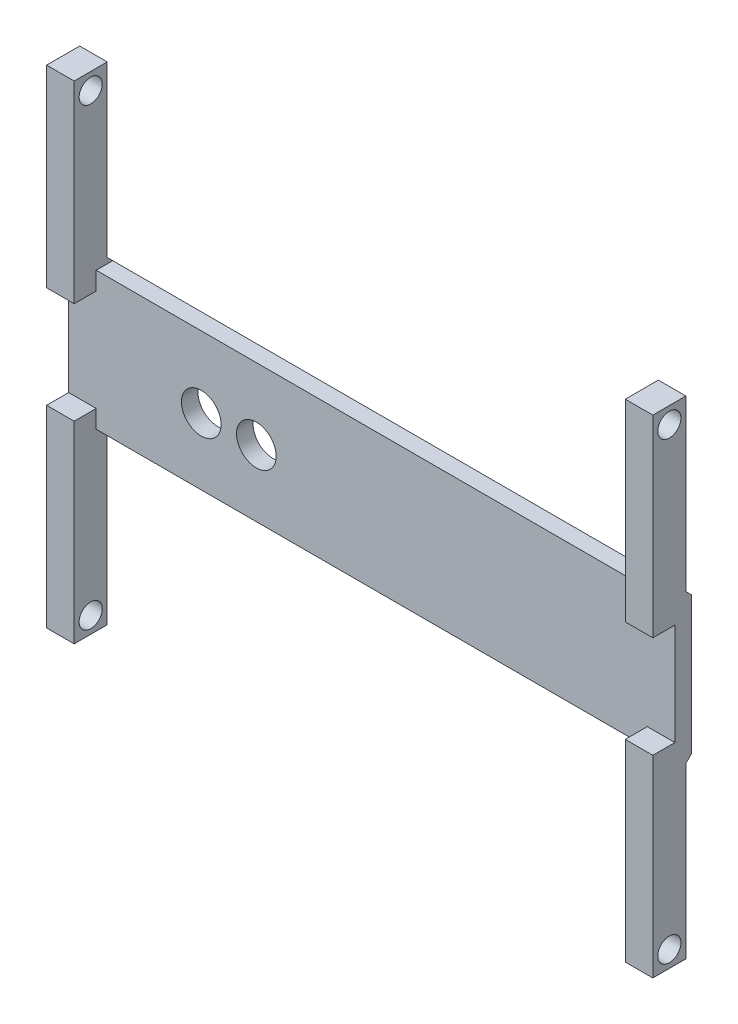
ISO-10303-21;
HEADER;
FILE_DESCRIPTION(('STEP AP214'),'2;1');
FILE_NAME('part.step','',(''),(''),'','','');
FILE_SCHEMA(('AUTOMOTIVE_DESIGN { 1 0 10303 214 1 1 1 1 }'));
ENDSEC;
DATA;
#1=APPLICATION_CONTEXT('core data for automotive mechanical design processes');
#2=APPLICATION_PROTOCOL_DEFINITION('international standard','automotive_design',2000,#1);
#3=PRODUCT_CONTEXT('',#1,'mechanical');
#4=PRODUCT('Part','Part','',(#3));
#5=PRODUCT_RELATED_PRODUCT_CATEGORY('part','',(#4));
#6=PRODUCT_DEFINITION_FORMATION('','',#4);
#7=PRODUCT_DEFINITION_CONTEXT('part definition',#1,'design');
#8=PRODUCT_DEFINITION('design','',#6,#7);
#9=PRODUCT_DEFINITION_SHAPE('','',#8);
#10=(LENGTH_UNIT() NAMED_UNIT(*) SI_UNIT(.MILLI.,.METRE.));
#11=(NAMED_UNIT(*) PLANE_ANGLE_UNIT() SI_UNIT($,.RADIAN.));
#12=(NAMED_UNIT(*) SI_UNIT($,.STERADIAN.) SOLID_ANGLE_UNIT());
#13=UNCERTAINTY_MEASURE_WITH_UNIT(LENGTH_MEASURE(1.E-05),#10,'distance_accuracy_value','');
#14=(GEOMETRIC_REPRESENTATION_CONTEXT(3) GLOBAL_UNCERTAINTY_ASSIGNED_CONTEXT((#13)) GLOBAL_UNIT_ASSIGNED_CONTEXT((#10,
#11,#12)) REPRESENTATION_CONTEXT('',''));
#15=CARTESIAN_POINT('',(0.,0.,0.));
#16=DIRECTION('',(0.,0.,1.));
#17=DIRECTION('',(1.,0.,0.));
#18=AXIS2_PLACEMENT_3D('',#15,#16,#17);
#19=CARTESIAN_POINT('',(50.,-9.22974479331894,0.));
#20=DIRECTION('',(0.,-1.,0.));
#21=DIRECTION('',(1.,0.,0.));
#22=AXIS2_PLACEMENT_3D('',#19,#20,#21);
#23=PLANE('',#22);
#24=DIRECTION('',(0.,0.,1.));
#25=VECTOR('',#24,1.);
#26=CARTESIAN_POINT('',(55.,-9.22974479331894,3.));
#27=LINE('',#26,#25);
#28=CARTESIAN_POINT('',(55.,-9.22974479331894,3.));
#29=VERTEX_POINT('',#28);
#30=CARTESIAN_POINT('',(55.,-9.22974479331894,7.00000000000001));
#31=VERTEX_POINT('',#30);
#32=EDGE_CURVE('E488',#29,#31,#27,.T.);
#33=ORIENTED_EDGE('',*,*,#32,.F.);
#34=DIRECTION('',(-1.,0.,0.));
#35=VECTOR('',#34,1.);
#36=CARTESIAN_POINT('',(0.,-9.22974479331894,3.));
#37=LINE('',#36,#35);
#38=CARTESIAN_POINT('',(50.,-9.22974479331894,3.));
#39=VERTEX_POINT('',#38);
#40=EDGE_CURVE('E220',#29,#39,#37,.T.);
#41=ORIENTED_EDGE('',*,*,#40,.T.);
#42=DIRECTION('',(0.,0.,-1.));
#43=VECTOR('',#42,1.);
#44=CARTESIAN_POINT('',(50.,-9.22974479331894,7.00000000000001));
#45=LINE('',#44,#43);
#46=CARTESIAN_POINT('',(50.,-9.22974479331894,7.00000000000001));
#47=VERTEX_POINT('',#46);
#48=EDGE_CURVE('E250',#47,#39,#45,.T.);
#49=ORIENTED_EDGE('',*,*,#48,.F.);
#50=DIRECTION('',(1.,0.,0.));
#51=VECTOR('',#50,1.);
#52=CARTESIAN_POINT('',(50.,-9.22974479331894,7.00000000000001));
#53=LINE('',#52,#51);
#54=EDGE_CURVE('E261',#47,#31,#53,.T.);
#55=ORIENTED_EDGE('',*,*,#54,.T.);
#56=EDGE_LOOP('',(#33,#41,#49,#55));
#57=FACE_BOUND('',#56,.T.);
#58=ADVANCED_FACE('F39',(#57),#23,.F.);
#59=CARTESIAN_POINT('',(50.,-44.2297447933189,1.00000000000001));
#60=DIRECTION('',(0.,0.,1.));
#61=DIRECTION('',(1.,0.,0.));
#62=AXIS2_PLACEMENT_3D('',#59,#60,#61);
#63=PLANE('',#62);
#64=DIRECTION('',(0.,1.,0.));
#65=VECTOR('',#64,1.);
#66=CARTESIAN_POINT('',(55.,-44.2297447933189,1.00000000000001));
#67=LINE('',#66,#65);
#68=CARTESIAN_POINT('',(55.,-44.2297447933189,1.00000000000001));
#69=VERTEX_POINT('',#68);
#70=CARTESIAN_POINT('',(55.,-13.5,1.00000000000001));
#71=VERTEX_POINT('',#70);
#72=EDGE_CURVE('E56',#69,#71,#67,.T.);
#73=ORIENTED_EDGE('',*,*,#72,.F.);
#74=DIRECTION('',(1.,0.,0.));
#75=VECTOR('',#74,1.);
#76=CARTESIAN_POINT('',(50.,-44.2297447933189,1.00000000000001));
#77=LINE('',#76,#75);
#78=CARTESIAN_POINT('',(50.,-44.2297447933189,1.00000000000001));
#79=VERTEX_POINT('',#78);
#80=EDGE_CURVE('E267',#79,#69,#77,.T.);
#81=ORIENTED_EDGE('',*,*,#80,.F.);
#82=DIRECTION('',(0.,-1.,0.));
#83=VECTOR('',#82,1.);
#84=CARTESIAN_POINT('',(50.,-44.2297447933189,1.00000000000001));
#85=LINE('',#84,#83);
#86=CARTESIAN_POINT('',(50.,-13.5,1.00000000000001));
#87=VERTEX_POINT('',#86);
#88=EDGE_CURVE('E237',#87,#79,#85,.T.);
#89=ORIENTED_EDGE('',*,*,#88,.F.);
#90=DIRECTION('',(1.,0.,0.));
#91=VECTOR('',#90,1.);
#92=CARTESIAN_POINT('',(50.,-13.5,1.00000000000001));
#93=LINE('',#92,#91);
#94=EDGE_CURVE('E255',#87,#71,#93,.T.);
#95=ORIENTED_EDGE('',*,*,#94,.T.);
#96=EDGE_LOOP('',(#73,#81,#89,#95));
#97=FACE_BOUND('',#96,.T.);
#98=ADVANCED_FACE('F523',(#97),#63,.F.);
#99=CARTESIAN_POINT('',(50.,-44.2297447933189,1.00000000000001));
#100=DIRECTION('',(0.,1.,0.));
#101=DIRECTION('',(-1.,0.,0.));
#102=AXIS2_PLACEMENT_3D('',#99,#100,#101);
#103=PLANE('',#102);
#104=DIRECTION('',(0.,0.,-1.));
#105=VECTOR('',#104,1.);
#106=CARTESIAN_POINT('',(55.,-44.2297447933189,7.00000000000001));
#107=LINE('',#106,#105);
#108=CARTESIAN_POINT('',(55.,-44.2297447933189,7.00000000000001));
#109=VERTEX_POINT('',#108);
#110=EDGE_CURVE('E493',#109,#69,#107,.T.);
#111=ORIENTED_EDGE('',*,*,#110,.F.);
#112=DIRECTION('',(1.,0.,0.));
#113=VECTOR('',#112,1.);
#114=CARTESIAN_POINT('',(50.,-44.2297447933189,7.00000000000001));
#115=LINE('',#114,#113);
#116=CARTESIAN_POINT('',(50.,-44.2297447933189,7.00000000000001));
#117=VERTEX_POINT('',#116);
#118=EDGE_CURVE('E264',#117,#109,#115,.T.);
#119=ORIENTED_EDGE('',*,*,#118,.F.);
#120=DIRECTION('',(0.,0.,1.));
#121=VECTOR('',#120,1.);
#122=CARTESIAN_POINT('',(50.,-44.2297447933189,1.00000000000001));
#123=LINE('',#122,#121);
#124=EDGE_CURVE('E241',#79,#117,#123,.T.);
#125=ORIENTED_EDGE('',*,*,#124,.F.);
#126=ORIENTED_EDGE('',*,*,#80,.T.);
#127=EDGE_LOOP('',(#111,#119,#125,#126));
#128=FACE_BOUND('',#127,.T.);
#129=ADVANCED_FACE('F529',(#128),#103,.F.);
#130=CARTESIAN_POINT('',(50.,-44.2297447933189,7.00000000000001));
#131=DIRECTION('',(0.,0.,-1.));
#132=DIRECTION('',(0.,1.,0.));
#133=AXIS2_PLACEMENT_3D('',#130,#131,#132);
#134=PLANE('',#133);
#135=DIRECTION('',(0.,-1.,0.));
#136=VECTOR('',#135,1.);
#137=CARTESIAN_POINT('',(55.,-9.22974479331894,7.00000000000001));
#138=LINE('',#137,#136);
#139=EDGE_CURVE('E490',#31,#109,#138,.T.);
#140=ORIENTED_EDGE('',*,*,#139,.F.);
#141=ORIENTED_EDGE('',*,*,#54,.F.);
#142=DIRECTION('',(0.,1.,0.));
#143=VECTOR('',#142,1.);
#144=CARTESIAN_POINT('',(50.,-44.2297447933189,7.00000000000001));
#145=LINE('',#144,#143);
#146=EDGE_CURVE('E248',#117,#47,#145,.T.);
#147=ORIENTED_EDGE('',*,*,#146,.F.);
#148=ORIENTED_EDGE('',*,*,#118,.T.);
#149=EDGE_LOOP('',(#140,#141,#147,#148));
#150=FACE_BOUND('',#149,.T.);
#151=ADVANCED_FACE('F535',(#150),#134,.F.);
#152=CARTESIAN_POINT('',(50.,-12.5,0.));
#153=DIRECTION('',(0.,0.707106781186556,0.707106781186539));
#154=DIRECTION('',(0.,-0.707106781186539,0.707106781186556));
#155=AXIS2_PLACEMENT_3D('',#152,#153,#154);
#156=PLANE('',#155);
#157=DIRECTION('',(0.,0.707106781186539,-0.707106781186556));
#158=VECTOR('',#157,1.);
#159=CARTESIAN_POINT('',(55.,-13.5,1.00000000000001));
#160=LINE('',#159,#158);
#161=CARTESIAN_POINT('',(55.,-12.5,0.));
#162=VERTEX_POINT('',#161);
#163=EDGE_CURVE('E380',#71,#162,#160,.T.);
#164=ORIENTED_EDGE('',*,*,#163,.F.);
#165=ORIENTED_EDGE('',*,*,#94,.F.);
#166=DIRECTION('',(0.,-0.707106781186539,0.707106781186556));
#167=VECTOR('',#166,1.);
#168=CARTESIAN_POINT('',(50.,-12.5,0.));
#169=LINE('',#168,#167);
#170=CARTESIAN_POINT('',(50.,-12.5,0.));
#171=VERTEX_POINT('',#170);
#172=EDGE_CURVE('E253',#171,#87,#169,.T.);
#173=ORIENTED_EDGE('',*,*,#172,.F.);
#174=DIRECTION('',(1.,0.,0.));
#175=VECTOR('',#174,1.);
#176=CARTESIAN_POINT('',(50.,-12.5,0.));
#177=LINE('',#176,#175);
#178=EDGE_CURVE('E258',#171,#162,#177,.T.);
#179=ORIENTED_EDGE('',*,*,#178,.T.);
#180=EDGE_LOOP('',(#164,#165,#173,#179));
#181=FACE_BOUND('',#180,.T.);
#182=ADVANCED_FACE('F386',(#181),#156,.F.);
#183=CARTESIAN_POINT('',(-50.,12.5,0.));
#184=DIRECTION('',(0.,0.707106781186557,-0.707106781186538));
#185=DIRECTION('',(0.,0.707106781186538,0.707106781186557));
#186=AXIS2_PLACEMENT_3D('',#183,#184,#185);
#187=PLANE('',#186);
#188=DIRECTION('',(-1.,0.,0.));
#189=VECTOR('',#188,1.);
#190=CARTESIAN_POINT('',(-50.,12.5,0.));
#191=LINE('',#190,#189);
#192=CARTESIAN_POINT('',(-50.,12.5,0.));
#193=VERTEX_POINT('',#192);
#194=CARTESIAN_POINT('',(-55.,12.5,0.));
#195=VERTEX_POINT('',#194);
#196=EDGE_CURVE('E323',#193,#195,#191,.T.);
#197=ORIENTED_EDGE('',*,*,#196,.T.);
#198=DIRECTION('',(0.,-0.707106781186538,-0.707106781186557));
#199=VECTOR('',#198,1.);
#200=CARTESIAN_POINT('',(-55.,13.5,1.00000000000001));
#201=LINE('',#200,#199);
#202=CARTESIAN_POINT('',(-55.,13.5,1.00000000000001));
#203=VERTEX_POINT('',#202);
#204=EDGE_CURVE('E500',#203,#195,#201,.T.);
#205=ORIENTED_EDGE('',*,*,#204,.F.);
#206=DIRECTION('',(-1.,0.,0.));
#207=VECTOR('',#206,1.);
#208=CARTESIAN_POINT('',(-50.,13.5,1.00000000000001));
#209=LINE('',#208,#207);
#210=CARTESIAN_POINT('',(-50.,13.5,1.00000000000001));
#211=VERTEX_POINT('',#210);
#212=EDGE_CURVE('E325',#211,#203,#209,.T.);
#213=ORIENTED_EDGE('',*,*,#212,.F.);
#214=DIRECTION('',(0.,-0.707106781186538,-0.707106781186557));
#215=VECTOR('',#214,1.);
#216=CARTESIAN_POINT('',(-50.,12.5,0.));
#217=LINE('',#216,#215);
#218=EDGE_CURVE('E314',#211,#193,#217,.T.);
#219=ORIENTED_EDGE('',*,*,#218,.T.);
#220=EDGE_LOOP('',(#197,#205,#213,#219));
#221=FACE_BOUND('',#220,.T.);
#222=ADVANCED_FACE('F321',(#221),#187,.T.);
#223=CARTESIAN_POINT('',(-50.,13.5,1.00000000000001));
#224=DIRECTION('',(0.,0.,-1.));
#225=DIRECTION('',(0.,1.,0.));
#226=AXIS2_PLACEMENT_3D('',#223,#224,#225);
#227=PLANE('',#226);
#228=ORIENTED_EDGE('',*,*,#212,.T.);
#229=DIRECTION('',(0.,-1.,0.));
#230=VECTOR('',#229,1.);
#231=CARTESIAN_POINT('',(-55.,44.2297447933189,1.));
#232=LINE('',#231,#230);
#233=CARTESIAN_POINT('',(-55.,44.2297447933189,1.));
#234=VERTEX_POINT('',#233);
#235=EDGE_CURVE('E498',#234,#203,#232,.T.);
#236=ORIENTED_EDGE('',*,*,#235,.F.);
#237=DIRECTION('',(-1.,0.,0.));
#238=VECTOR('',#237,1.);
#239=CARTESIAN_POINT('',(-50.,44.2297447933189,1.));
#240=LINE('',#239,#238);
#241=CARTESIAN_POINT('',(-50.,44.2297447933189,1.));
#242=VERTEX_POINT('',#241);
#243=EDGE_CURVE('E339',#242,#234,#240,.T.);
#244=ORIENTED_EDGE('',*,*,#243,.F.);
#245=DIRECTION('',(0.,-1.,0.));
#246=VECTOR('',#245,1.);
#247=CARTESIAN_POINT('',(-50.,13.5,1.00000000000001));
#248=LINE('',#247,#246);
#249=EDGE_CURVE('E328',#242,#211,#248,.T.);
#250=ORIENTED_EDGE('',*,*,#249,.T.);
#251=EDGE_LOOP('',(#228,#236,#244,#250));
#252=FACE_BOUND('',#251,.T.);
#253=ADVANCED_FACE('F856',(#252),#227,.T.);
#254=CARTESIAN_POINT('',(-50.,44.2297447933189,1.));
#255=DIRECTION('',(0.,1.,0.));
#256=DIRECTION('',(0.,0.,1.));
#257=AXIS2_PLACEMENT_3D('',#254,#255,#256);
#258=PLANE('',#257);
#259=ORIENTED_EDGE('',*,*,#243,.T.);
#260=DIRECTION('',(0.,0.,-1.));
#261=VECTOR('',#260,1.);
#262=CARTESIAN_POINT('',(-55.,44.2297447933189,7.));
#263=LINE('',#262,#261);
#264=CARTESIAN_POINT('',(-55.,44.2297447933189,7.));
#265=VERTEX_POINT('',#264);
#266=EDGE_CURVE('E415',#265,#234,#263,.T.);
#267=ORIENTED_EDGE('',*,*,#266,.F.);
#268=DIRECTION('',(-1.,0.,0.));
#269=VECTOR('',#268,1.);
#270=CARTESIAN_POINT('',(-50.,44.2297447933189,7.));
#271=LINE('',#270,#269);
#272=CARTESIAN_POINT('',(-50.,44.2297447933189,7.));
#273=VERTEX_POINT('',#272);
#274=EDGE_CURVE('E342',#273,#265,#271,.T.);
#275=ORIENTED_EDGE('',*,*,#274,.F.);
#276=DIRECTION('',(0.,0.,-1.));
#277=VECTOR('',#276,1.);
#278=CARTESIAN_POINT('',(-50.,44.2297447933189,1.));
#279=LINE('',#278,#277);
#280=EDGE_CURVE('E332',#273,#242,#279,.T.);
#281=ORIENTED_EDGE('',*,*,#280,.T.);
#282=EDGE_LOOP('',(#259,#267,#275,#281));
#283=FACE_BOUND('',#282,.T.);
#284=ADVANCED_FACE('F459',(#283),#258,.T.);
#285=CARTESIAN_POINT('',(-50.,44.2297447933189,7.));
#286=DIRECTION('',(0.,0.,1.));
#287=DIRECTION('',(0.,-1.,0.));
#288=AXIS2_PLACEMENT_3D('',#285,#286,#287);
#289=PLANE('',#288);
#290=ORIENTED_EDGE('',*,*,#274,.T.);
#291=DIRECTION('',(0.,1.,0.));
#292=VECTOR('',#291,1.);
#293=CARTESIAN_POINT('',(-55.,9.22974479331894,7.00000000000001));
#294=LINE('',#293,#292);
#295=CARTESIAN_POINT('',(-55.,9.22974479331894,7.00000000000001));
#296=VERTEX_POINT('',#295);
#297=EDGE_CURVE('E435',#296,#265,#294,.T.);
#298=ORIENTED_EDGE('',*,*,#297,.F.);
#299=DIRECTION('',(-1.,0.,0.));
#300=VECTOR('',#299,1.);
#301=CARTESIAN_POINT('',(-50.,9.22974479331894,7.00000000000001));
#302=LINE('',#301,#300);
#303=CARTESIAN_POINT('',(-50.,9.22974479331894,7.00000000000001));
#304=VERTEX_POINT('',#303);
#305=EDGE_CURVE('E330',#304,#296,#302,.T.);
#306=ORIENTED_EDGE('',*,*,#305,.F.);
#307=DIRECTION('',(0.,1.,0.));
#308=VECTOR('',#307,1.);
#309=CARTESIAN_POINT('',(-50.,44.2297447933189,7.));
#310=LINE('',#309,#308);
#311=EDGE_CURVE('E454',#304,#273,#310,.T.);
#312=ORIENTED_EDGE('',*,*,#311,.T.);
#313=EDGE_LOOP('',(#290,#298,#306,#312));
#314=FACE_BOUND('',#313,.T.);
#315=ADVANCED_FACE('F463',(#314),#289,.T.);
#316=CARTESIAN_POINT('',(-50.,9.22974479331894,7.00000000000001));
#317=DIRECTION('',(0.,-1.,0.));
#318=DIRECTION('',(0.,0.,-1.));
#319=AXIS2_PLACEMENT_3D('',#316,#317,#318);
#320=PLANE('',#319);
#321=ORIENTED_EDGE('',*,*,#305,.T.);
#322=DIRECTION('',(0.,0.,1.));
#323=VECTOR('',#322,1.);
#324=CARTESIAN_POINT('',(-55.,9.22974479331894,3.));
#325=LINE('',#324,#323);
#326=CARTESIAN_POINT('',(-55.,9.22974479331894,3.));
#327=VERTEX_POINT('',#326);
#328=EDGE_CURVE('E469',#327,#296,#325,.T.);
#329=ORIENTED_EDGE('',*,*,#328,.F.);
#330=DIRECTION('',(-1.,0.,0.));
#331=VECTOR('',#330,1.);
#332=CARTESIAN_POINT('',(-50.,9.22974479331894,3.));
#333=LINE('',#332,#331);
#334=CARTESIAN_POINT('',(-50.,9.22974479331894,3.));
#335=VERTEX_POINT('',#334);
#336=EDGE_CURVE('E327',#335,#327,#333,.T.);
#337=ORIENTED_EDGE('',*,*,#336,.F.);
#338=DIRECTION('',(0.,0.,1.));
#339=VECTOR('',#338,1.);
#340=CARTESIAN_POINT('',(-50.,9.22974479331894,7.00000000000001));
#341=LINE('',#340,#339);
#342=EDGE_CURVE('E451',#335,#304,#341,.T.);
#343=ORIENTED_EDGE('',*,*,#342,.T.);
#344=EDGE_LOOP('',(#321,#329,#337,#343));
#345=FACE_BOUND('',#344,.T.);
#346=ADVANCED_FACE('F467',(#345),#320,.T.);
#347=CARTESIAN_POINT('',(0.,0.,3.));
#348=DIRECTION('',(0.,0.,-1.));
#349=DIRECTION('',(-1.,0.,0.));
#350=AXIS2_PLACEMENT_3D('',#347,#348,#349);
#351=PLANE('',#350);
#352=CARTESIAN_POINT('',(-20.9390025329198,-0.444762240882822,3.));
#353=DIRECTION('',(0.,0.,1.));
#354=DIRECTION('',(1.,0.,0.));
#355=AXIS2_PLACEMENT_3D('',#352,#353,#354);
#356=CIRCLE('',#355,3.6);
#357=CARTESIAN_POINT('',(-17.3390025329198,-0.444762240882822,3.));
#358=VERTEX_POINT('',#357);
#359=EDGE_CURVE('E278',#358,#358,#356,.T.);
#360=ORIENTED_EDGE('',*,*,#359,.F.);
#361=EDGE_LOOP('',(#360));
#362=FACE_BOUND('',#361,.T.);
#363=CARTESIAN_POINT('',(-30.9390025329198,-0.444762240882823,3.));
#364=DIRECTION('',(0.,0.,1.));
#365=DIRECTION('',(1.,0.,0.));
#366=AXIS2_PLACEMENT_3D('',#363,#364,#365);
#367=CIRCLE('',#366,3.6);
#368=CARTESIAN_POINT('',(-27.3390025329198,-0.444762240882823,3.));
#369=VERTEX_POINT('',#368);
#370=EDGE_CURVE('E277',#369,#369,#367,.T.);
#371=ORIENTED_EDGE('',*,*,#370,.F.);
#372=EDGE_LOOP('',(#371));
#373=FACE_BOUND('',#372,.T.);
#374=ORIENTED_EDGE('',*,*,#336,.T.);
#375=DIRECTION('',(0.,1.,0.));
#376=VECTOR('',#375,1.);
#377=CARTESIAN_POINT('',(-55.,12.5,3.));
#378=LINE('',#377,#376);
#379=CARTESIAN_POINT('',(-55.,-9.22974479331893,3.));
#380=VERTEX_POINT('',#379);
#381=EDGE_CURVE('E222',#380,#327,#378,.T.);
#382=ORIENTED_EDGE('',*,*,#381,.F.);
#383=DIRECTION('',(-1.,0.,0.));
#384=VECTOR('',#383,1.);
#385=CARTESIAN_POINT('',(-50.,-9.22974479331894,3.));
#386=LINE('',#385,#384);
#387=CARTESIAN_POINT('',(-50.,-9.22974479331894,3.));
#388=VERTEX_POINT('',#387);
#389=EDGE_CURVE('E432',#388,#380,#386,.T.);
#390=ORIENTED_EDGE('',*,*,#389,.F.);
#391=DIRECTION('',(0.,-1.,0.));
#392=VECTOR('',#391,1.);
#393=CARTESIAN_POINT('',(-50.,-9.22974479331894,3.));
#394=LINE('',#393,#392);
#395=CARTESIAN_POINT('',(-50.,-12.5,3.));
#396=VERTEX_POINT('',#395);
#397=EDGE_CURVE('E317',#388,#396,#394,.T.);
#398=ORIENTED_EDGE('',*,*,#397,.T.);
#399=DIRECTION('',(1.,0.,0.));
#400=VECTOR('',#399,1.);
#401=CARTESIAN_POINT('',(-58.,-12.5,3.));
#402=LINE('',#401,#400);
#403=CARTESIAN_POINT('',(50.,-12.5,3.));
#404=VERTEX_POINT('',#403);
#405=EDGE_CURVE('E11',#396,#404,#402,.T.);
#406=ORIENTED_EDGE('',*,*,#405,.T.);
#407=DIRECTION('',(0.,-1.,0.));
#408=VECTOR('',#407,1.);
#409=CARTESIAN_POINT('',(50.,0.,3.));
#410=LINE('',#409,#408);
#411=EDGE_CURVE('E270',#39,#404,#410,.T.);
#412=ORIENTED_EDGE('',*,*,#411,.F.);
#413=ORIENTED_EDGE('',*,*,#40,.F.);
#414=DIRECTION('',(0.,-1.,0.));
#415=VECTOR('',#414,1.);
#416=CARTESIAN_POINT('',(55.,12.5,3.));
#417=LINE('',#416,#415);
#418=CARTESIAN_POINT('',(55.,9.22974479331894,3.));
#419=VERTEX_POINT('',#418);
#420=EDGE_CURVE('E212',#419,#29,#417,.T.);
#421=ORIENTED_EDGE('',*,*,#420,.F.);
#422=DIRECTION('',(1.,0.,0.));
#423=VECTOR('',#422,1.);
#424=CARTESIAN_POINT('',(0.,9.22974479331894,3.));
#425=LINE('',#424,#423);
#426=CARTESIAN_POINT('',(50.,9.22974479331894,3.));
#427=VERTEX_POINT('',#426);
#428=EDGE_CURVE('E217',#427,#419,#425,.T.);
#429=ORIENTED_EDGE('',*,*,#428,.F.);
#430=DIRECTION('',(0.,-1.,0.));
#431=VECTOR('',#430,1.);
#432=CARTESIAN_POINT('',(50.,0.,3.));
#433=LINE('',#432,#431);
#434=CARTESIAN_POINT('',(50.,12.5,3.));
#435=VERTEX_POINT('',#434);
#436=EDGE_CURVE('E238',#435,#427,#433,.T.);
#437=ORIENTED_EDGE('',*,*,#436,.F.);
#438=DIRECTION('',(-1.,0.,0.));
#439=VECTOR('',#438,1.);
#440=CARTESIAN_POINT('',(-58.,12.5,3.));
#441=LINE('',#440,#439);
#442=CARTESIAN_POINT('',(-50.,12.5,3.));
#443=VERTEX_POINT('',#442);
#444=EDGE_CURVE('E48',#435,#443,#441,.T.);
#445=ORIENTED_EDGE('',*,*,#444,.T.);
#446=DIRECTION('',(0.,-1.,0.));
#447=VECTOR('',#446,1.);
#448=CARTESIAN_POINT('',(-50.,9.22974479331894,3.));
#449=LINE('',#448,#447);
#450=EDGE_CURVE('E316',#443,#335,#449,.T.);
#451=ORIENTED_EDGE('',*,*,#450,.T.);
#452=EDGE_LOOP('',(#374,#382,#390,#398,#406,#412,#413,#421,#429,#437,#445,#451));
#453=FACE_BOUND('',#452,.T.);
#454=ADVANCED_FACE('F215',(#362,#373,#453),#351,.F.);
#455=CARTESIAN_POINT('',(-58.,12.5,3.));
#456=DIRECTION('',(0.,-1.,0.));
#457=DIRECTION('',(0.,0.,-1.));
#458=AXIS2_PLACEMENT_3D('',#455,#456,#457);
#459=PLANE('',#458);
#460=DIRECTION('',(-1.,0.,0.));
#461=VECTOR('',#460,1.);
#462=CARTESIAN_POINT('',(-58.,12.5,0.));
#463=LINE('',#462,#461);
#464=CARTESIAN_POINT('',(50.,12.5,0.));
#465=VERTEX_POINT('',#464);
#466=EDGE_CURVE('E290',#465,#193,#463,.T.);
#467=ORIENTED_EDGE('',*,*,#466,.T.);
#468=DIRECTION('',(0.,0.,1.));
#469=VECTOR('',#468,1.);
#470=CARTESIAN_POINT('',(-50.,12.5,3.));
#471=LINE('',#470,#469);
#472=EDGE_CURVE('E303',#193,#443,#471,.T.);
#473=ORIENTED_EDGE('',*,*,#472,.T.);
#474=ORIENTED_EDGE('',*,*,#444,.F.);
#475=DIRECTION('',(0.,0.,1.));
#476=VECTOR('',#475,1.);
#477=CARTESIAN_POINT('',(50.,12.5,3.));
#478=LINE('',#477,#476);
#479=EDGE_CURVE('E243',#465,#435,#478,.T.);
#480=ORIENTED_EDGE('',*,*,#479,.F.);
#481=EDGE_LOOP('',(#467,#473,#474,#480));
#482=FACE_BOUND('',#481,.T.);
#483=ADVANCED_FACE('F41',(#482),#459,.F.);
#484=CARTESIAN_POINT('',(-58.,-12.5,3.));
#485=DIRECTION('',(0.,1.,0.));
#486=DIRECTION('',(0.,0.,1.));
#487=AXIS2_PLACEMENT_3D('',#484,#485,#486);
#488=PLANE('',#487);
#489=ORIENTED_EDGE('',*,*,#405,.F.);
#490=DIRECTION('',(0.,0.,-1.));
#491=VECTOR('',#490,1.);
#492=CARTESIAN_POINT('',(-50.,-12.5,3.));
#493=LINE('',#492,#491);
#494=CARTESIAN_POINT('',(-50.,-12.5,0.));
#495=VERTEX_POINT('',#494);
#496=EDGE_CURVE('E397',#396,#495,#493,.T.);
#497=ORIENTED_EDGE('',*,*,#496,.T.);
#498=DIRECTION('',(1.,0.,0.));
#499=VECTOR('',#498,1.);
#500=CARTESIAN_POINT('',(-58.,-12.5,0.));
#501=LINE('',#500,#499);
#502=EDGE_CURVE('E289',#495,#171,#501,.T.);
#503=ORIENTED_EDGE('',*,*,#502,.T.);
#504=DIRECTION('',(0.,0.,-1.));
#505=VECTOR('',#504,1.);
#506=CARTESIAN_POINT('',(50.,-12.5,3.));
#507=LINE('',#506,#505);
#508=EDGE_CURVE('E273',#404,#171,#507,.T.);
#509=ORIENTED_EDGE('',*,*,#508,.F.);
#510=EDGE_LOOP('',(#489,#497,#503,#509));
#511=FACE_BOUND('',#510,.T.);
#512=ADVANCED_FACE('F394',(#511),#488,.F.);
#513=CARTESIAN_POINT('',(0.,0.,0.));
#514=DIRECTION('',(0.,0.,-1.));
#515=DIRECTION('',(-1.,0.,0.));
#516=AXIS2_PLACEMENT_3D('',#513,#514,#515);
#517=PLANE('',#516);
#518=DIRECTION('',(0.,-1.,0.));
#519=VECTOR('',#518,1.);
#520=CARTESIAN_POINT('',(-55.,0.,0.));
#521=LINE('',#520,#519);
#522=CARTESIAN_POINT('',(-55.,-12.5,0.));
#523=VERTEX_POINT('',#522);
#524=EDGE_CURVE('E378',#195,#523,#521,.T.);
#525=ORIENTED_EDGE('',*,*,#524,.F.);
#526=ORIENTED_EDGE('',*,*,#196,.F.);
#527=ORIENTED_EDGE('',*,*,#466,.F.);
#528=CARTESIAN_POINT('',(55.,12.5,0.));
#529=VERTEX_POINT('',#528);
#530=EDGE_CURVE('E287',#529,#465,#463,.T.);
#531=ORIENTED_EDGE('',*,*,#530,.F.);
#532=DIRECTION('',(0.,1.,0.));
#533=VECTOR('',#532,1.);
#534=CARTESIAN_POINT('',(55.,0.,0.));
#535=LINE('',#534,#533);
#536=EDGE_CURVE('E376',#162,#529,#535,.T.);
#537=ORIENTED_EDGE('',*,*,#536,.F.);
#538=ORIENTED_EDGE('',*,*,#178,.F.);
#539=ORIENTED_EDGE('',*,*,#502,.F.);
#540=EDGE_CURVE('E285',#523,#495,#501,.T.);
#541=ORIENTED_EDGE('',*,*,#540,.F.);
#542=EDGE_LOOP('',(#525,#526,#527,#531,#537,#538,#539,#541));
#543=FACE_BOUND('',#542,.T.);
#544=CARTESIAN_POINT('',(-20.9390025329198,-0.444762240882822,0.));
#545=DIRECTION('',(0.,0.,-1.));
#546=DIRECTION('',(-1.,0.,0.));
#547=AXIS2_PLACEMENT_3D('',#544,#545,#546);
#548=CIRCLE('',#547,3.6);
#549=CARTESIAN_POINT('',(-24.5390025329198,-0.444762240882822,0.));
#550=VERTEX_POINT('',#549);
#551=EDGE_CURVE('E43',#550,#550,#548,.T.);
#552=ORIENTED_EDGE('',*,*,#551,.F.);
#553=EDGE_LOOP('',(#552));
#554=FACE_BOUND('',#553,.T.);
#555=CARTESIAN_POINT('',(-30.9390025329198,-0.444762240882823,0.));
#556=DIRECTION('',(0.,0.,-1.));
#557=DIRECTION('',(-1.,0.,0.));
#558=AXIS2_PLACEMENT_3D('',#555,#556,#557);
#559=CIRCLE('',#558,3.6);
#560=CARTESIAN_POINT('',(-34.5390025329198,-0.444762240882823,0.));
#561=VERTEX_POINT('',#560);
#562=EDGE_CURVE('E281',#561,#561,#559,.T.);
#563=ORIENTED_EDGE('',*,*,#562,.F.);
#564=EDGE_LOOP('',(#563));
#565=FACE_BOUND('',#564,.T.);
#566=ADVANCED_FACE('F373',(#543,#554,#565),#517,.T.);
#567=CARTESIAN_POINT('',(-30.9390025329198,-0.444762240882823,-2.));
#568=DIRECTION('',(0.,0.,1.));
#569=DIRECTION('',(1.,0.,0.));
#570=AXIS2_PLACEMENT_3D('',#567,#568,#569);
#571=CYLINDRICAL_SURFACE('',#570,3.6);
#572=ORIENTED_EDGE('',*,*,#562,.T.);
#573=EDGE_LOOP('',(#572));
#574=FACE_BOUND('',#573,.T.);
#575=ORIENTED_EDGE('',*,*,#370,.T.);
#576=EDGE_LOOP('',(#575));
#577=FACE_BOUND('',#576,.T.);
#578=ADVANCED_FACE('F545',(#574,#577),#571,.F.);
#579=CARTESIAN_POINT('',(-20.9390025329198,-0.444762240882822,-2.));
#580=DIRECTION('',(0.,0.,1.));
#581=DIRECTION('',(1.,0.,0.));
#582=AXIS2_PLACEMENT_3D('',#579,#580,#581);
#583=CYLINDRICAL_SURFACE('',#582,3.6);
#584=ORIENTED_EDGE('',*,*,#551,.T.);
#585=EDGE_LOOP('',(#584));
#586=FACE_BOUND('',#585,.T.);
#587=ORIENTED_EDGE('',*,*,#359,.T.);
#588=EDGE_LOOP('',(#587));
#589=FACE_BOUND('',#588,.T.);
#590=ADVANCED_FACE('F542',(#586,#589),#583,.F.);
#591=CARTESIAN_POINT('',(50.,0.,0.));
#592=DIRECTION('',(1.,0.,0.));
#593=DIRECTION('',(0.,0.,-1.));
#594=AXIS2_PLACEMENT_3D('',#591,#592,#593);
#595=PLANE('',#594);
#596=CARTESIAN_POINT('',(50.,-41.2297447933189,4.));
#597=DIRECTION('',(-1.,0.,0.));
#598=DIRECTION('',(0.,0.,1.));
#599=AXIS2_PLACEMENT_3D('',#596,#597,#598);
#600=CIRCLE('',#599,2.1);
#601=CARTESIAN_POINT('',(50.,-41.2297447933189,6.1));
#602=VERTEX_POINT('',#601);
#603=EDGE_CURVE('E726',#602,#602,#600,.T.);
#604=ORIENTED_EDGE('',*,*,#603,.F.);
#605=EDGE_LOOP('',(#604));
#606=FACE_BOUND('',#605,.T.);
#607=ORIENTED_EDGE('',*,*,#411,.T.);
#608=ORIENTED_EDGE('',*,*,#508,.T.);
#609=ORIENTED_EDGE('',*,*,#172,.T.);
#610=ORIENTED_EDGE('',*,*,#88,.T.);
#611=ORIENTED_EDGE('',*,*,#124,.T.);
#612=ORIENTED_EDGE('',*,*,#146,.T.);
#613=ORIENTED_EDGE('',*,*,#48,.T.);
#614=EDGE_LOOP('',(#607,#608,#609,#610,#611,#612,#613));
#615=FACE_BOUND('',#614,.T.);
#616=ADVANCED_FACE('F389',(#606,#615),#595,.F.);
#617=CARTESIAN_POINT('',(50.,9.22974479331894,7.00000000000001));
#618=DIRECTION('',(0.,1.,0.));
#619=DIRECTION('',(-1.,0.,0.));
#620=AXIS2_PLACEMENT_3D('',#617,#618,#619);
#621=PLANE('',#620);
#622=ORIENTED_EDGE('',*,*,#428,.T.);
#623=DIRECTION('',(0.,0.,-1.));
#624=VECTOR('',#623,1.);
#625=CARTESIAN_POINT('',(55.,9.22974479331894,3.00000000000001));
#626=LINE('',#625,#624);
#627=CARTESIAN_POINT('',(55.,9.22974479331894,7.00000000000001));
#628=VERTEX_POINT('',#627);
#629=EDGE_CURVE('E225',#628,#419,#626,.T.);
#630=ORIENTED_EDGE('',*,*,#629,.F.);
#631=DIRECTION('',(1.,0.,0.));
#632=VECTOR('',#631,1.);
#633=CARTESIAN_POINT('',(50.,9.22974479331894,7.00000000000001));
#634=LINE('',#633,#632);
#635=CARTESIAN_POINT('',(50.,9.22974479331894,7.00000000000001));
#636=VERTEX_POINT('',#635);
#637=EDGE_CURVE('E352',#636,#628,#634,.T.);
#638=ORIENTED_EDGE('',*,*,#637,.F.);
#639=DIRECTION('',(0.,0.,1.));
#640=VECTOR('',#639,1.);
#641=CARTESIAN_POINT('',(50.,9.22974479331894,0.));
#642=LINE('',#641,#640);
#643=EDGE_CURVE('E236',#427,#636,#642,.T.);
#644=ORIENTED_EDGE('',*,*,#643,.F.);
#645=EDGE_LOOP('',(#622,#630,#638,#644));
#646=FACE_BOUND('',#645,.T.);
#647=ADVANCED_FACE('F235',(#646),#621,.F.);
#648=CARTESIAN_POINT('',(50.,0.,0.));
#649=DIRECTION('',(1.,0.,0.));
#650=DIRECTION('',(0.,0.,-1.));
#651=AXIS2_PLACEMENT_3D('',#648,#649,#650);
#652=PLANE('',#651);
#653=CARTESIAN_POINT('',(50.,41.2297447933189,4.));
#654=DIRECTION('',(-1.,0.,0.));
#655=DIRECTION('',(0.,0.,1.));
#656=AXIS2_PLACEMENT_3D('',#653,#654,#655);
#657=CIRCLE('',#656,2.1);
#658=CARTESIAN_POINT('',(50.,41.2297447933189,6.1));
#659=VERTEX_POINT('',#658);
#660=EDGE_CURVE('E724',#659,#659,#657,.T.);
#661=ORIENTED_EDGE('',*,*,#660,.F.);
#662=EDGE_LOOP('',(#661));
#663=FACE_BOUND('',#662,.T.);
#664=ORIENTED_EDGE('',*,*,#479,.T.);
#665=ORIENTED_EDGE('',*,*,#436,.T.);
#666=ORIENTED_EDGE('',*,*,#643,.T.);
#667=DIRECTION('',(0.,1.,0.));
#668=VECTOR('',#667,1.);
#669=CARTESIAN_POINT('',(50.,44.2297447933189,7.));
#670=LINE('',#669,#668);
#671=CARTESIAN_POINT('',(50.,44.2297447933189,7.));
#672=VERTEX_POINT('',#671);
#673=EDGE_CURVE('E357',#636,#672,#670,.T.);
#674=ORIENTED_EDGE('',*,*,#673,.T.);
#675=DIRECTION('',(0.,0.,-1.));
#676=VECTOR('',#675,1.);
#677=CARTESIAN_POINT('',(50.,44.2297447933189,1.));
#678=LINE('',#677,#676);
#679=CARTESIAN_POINT('',(50.,44.2297447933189,1.));
#680=VERTEX_POINT('',#679);
#681=EDGE_CURVE('E364',#672,#680,#678,.T.);
#682=ORIENTED_EDGE('',*,*,#681,.T.);
#683=DIRECTION('',(0.,-1.,0.));
#684=VECTOR('',#683,1.);
#685=CARTESIAN_POINT('',(50.,44.2297447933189,1.));
#686=LINE('',#685,#684);
#687=CARTESIAN_POINT('',(50.,13.5,1.00000000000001));
#688=VERTEX_POINT('',#687);
#689=EDGE_CURVE('E362',#680,#688,#686,.T.);
#690=ORIENTED_EDGE('',*,*,#689,.T.);
#691=DIRECTION('',(0.,-0.707106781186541,-0.707106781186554));
#692=VECTOR('',#691,1.);
#693=CARTESIAN_POINT('',(50.,12.5,0.));
#694=LINE('',#693,#692);
#695=EDGE_CURVE('E360',#688,#465,#694,.T.);
#696=ORIENTED_EDGE('',*,*,#695,.T.);
#697=EDGE_LOOP('',(#664,#665,#666,#674,#682,#690,#696));
#698=FACE_BOUND('',#697,.T.);
#699=ADVANCED_FACE('F367',(#663,#698),#652,.F.);
#700=CARTESIAN_POINT('',(50.,44.2297447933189,1.));
#701=DIRECTION('',(0.,-1.,0.));
#702=DIRECTION('',(1.,0.,0.));
#703=AXIS2_PLACEMENT_3D('',#700,#701,#702);
#704=PLANE('',#703);
#705=DIRECTION('',(1.,0.,0.));
#706=VECTOR('',#705,1.);
#707=CARTESIAN_POINT('',(50.,44.2297447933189,7.));
#708=LINE('',#707,#706);
#709=CARTESIAN_POINT('',(55.,44.2297447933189,7.));
#710=VERTEX_POINT('',#709);
#711=EDGE_CURVE('E354',#672,#710,#708,.T.);
#712=ORIENTED_EDGE('',*,*,#711,.T.);
#713=DIRECTION('',(0.,0.,1.));
#714=VECTOR('',#713,1.);
#715=CARTESIAN_POINT('',(55.,44.2297447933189,7.));
#716=LINE('',#715,#714);
#717=CARTESIAN_POINT('',(55.,44.2297447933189,1.));
#718=VERTEX_POINT('',#717);
#719=EDGE_CURVE('E63',#718,#710,#716,.T.);
#720=ORIENTED_EDGE('',*,*,#719,.F.);
#721=DIRECTION('',(1.,0.,0.));
#722=VECTOR('',#721,1.);
#723=CARTESIAN_POINT('',(50.,44.2297447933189,1.));
#724=LINE('',#723,#722);
#725=EDGE_CURVE('E337',#680,#718,#724,.T.);
#726=ORIENTED_EDGE('',*,*,#725,.F.);
#727=ORIENTED_EDGE('',*,*,#681,.F.);
#728=EDGE_LOOP('',(#712,#720,#726,#727));
#729=FACE_BOUND('',#728,.T.);
#730=ADVANCED_FACE('F756',(#729),#704,.F.);
#731=CARTESIAN_POINT('',(50.,44.2297447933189,1.));
#732=DIRECTION('',(0.,0.,1.));
#733=DIRECTION('',(0.,-1.,0.));
#734=AXIS2_PLACEMENT_3D('',#731,#732,#733);
#735=PLANE('',#734);
#736=ORIENTED_EDGE('',*,*,#725,.T.);
#737=DIRECTION('',(0.,1.,0.));
#738=VECTOR('',#737,1.);
#739=CARTESIAN_POINT('',(55.,44.2297447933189,1.));
#740=LINE('',#739,#738);
#741=CARTESIAN_POINT('',(55.,13.5,1.00000000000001));
#742=VERTEX_POINT('',#741);
#743=EDGE_CURVE('E504',#742,#718,#740,.T.);
#744=ORIENTED_EDGE('',*,*,#743,.F.);
#745=DIRECTION('',(1.,0.,0.));
#746=VECTOR('',#745,1.);
#747=CARTESIAN_POINT('',(50.,13.5,1.00000000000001));
#748=LINE('',#747,#746);
#749=EDGE_CURVE('E349',#688,#742,#748,.T.);
#750=ORIENTED_EDGE('',*,*,#749,.F.);
#751=ORIENTED_EDGE('',*,*,#689,.F.);
#752=EDGE_LOOP('',(#736,#744,#750,#751));
#753=FACE_BOUND('',#752,.T.);
#754=ADVANCED_FACE('F596',(#753),#735,.F.);
#755=CARTESIAN_POINT('',(50.,12.5,0.));
#756=DIRECTION('',(0.,-0.707106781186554,0.707106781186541));
#757=DIRECTION('',(0.,-0.707106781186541,-0.707106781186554));
#758=AXIS2_PLACEMENT_3D('',#755,#756,#757);
#759=PLANE('',#758);
#760=ORIENTED_EDGE('',*,*,#749,.T.);
#761=DIRECTION('',(0.,0.707106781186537,0.707106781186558));
#762=VECTOR('',#761,1.);
#763=CARTESIAN_POINT('',(55.,13.5,1.00000000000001));
#764=LINE('',#763,#762);
#765=EDGE_CURVE('E232',#529,#742,#764,.T.);
#766=ORIENTED_EDGE('',*,*,#765,.F.);
#767=ORIENTED_EDGE('',*,*,#530,.T.);
#768=ORIENTED_EDGE('',*,*,#695,.F.);
#769=EDGE_LOOP('',(#760,#766,#767,#768));
#770=FACE_BOUND('',#769,.T.);
#771=ADVANCED_FACE('F371',(#770),#759,.F.);
#772=CARTESIAN_POINT('',(50.,44.2297447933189,7.));
#773=DIRECTION('',(0.,0.,-1.));
#774=DIRECTION('',(-1.,0.,0.));
#775=AXIS2_PLACEMENT_3D('',#772,#773,#774);
#776=PLANE('',#775);
#777=ORIENTED_EDGE('',*,*,#637,.T.);
#778=DIRECTION('',(0.,-1.,0.));
#779=VECTOR('',#778,1.);
#780=CARTESIAN_POINT('',(55.,9.22974479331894,7.00000000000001));
#781=LINE('',#780,#779);
#782=EDGE_CURVE('E228',#710,#628,#781,.T.);
#783=ORIENTED_EDGE('',*,*,#782,.F.);
#784=ORIENTED_EDGE('',*,*,#711,.F.);
#785=ORIENTED_EDGE('',*,*,#673,.F.);
#786=EDGE_LOOP('',(#777,#783,#784,#785));
#787=FACE_BOUND('',#786,.T.);
#788=ADVANCED_FACE('F595',(#787),#776,.F.);
#789=CARTESIAN_POINT('',(-50.,0.,0.));
#790=DIRECTION('',(1.,0.,0.));
#791=DIRECTION('',(0.,0.,-1.));
#792=AXIS2_PLACEMENT_3D('',#789,#790,#791);
#793=PLANE('',#792);
#794=CARTESIAN_POINT('',(-50.,41.2297447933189,4.));
#795=DIRECTION('',(1.,0.,0.));
#796=DIRECTION('',(0.,0.,-1.));
#797=AXIS2_PLACEMENT_3D('',#794,#795,#796);
#798=CIRCLE('',#797,2.1);
#799=CARTESIAN_POINT('',(-50.,41.2297447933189,1.9));
#800=VERTEX_POINT('',#799);
#801=EDGE_CURVE('E742',#800,#800,#798,.T.);
#802=ORIENTED_EDGE('',*,*,#801,.F.);
#803=EDGE_LOOP('',(#802));
#804=FACE_BOUND('',#803,.T.);
#805=ORIENTED_EDGE('',*,*,#472,.F.);
#806=ORIENTED_EDGE('',*,*,#218,.F.);
#807=ORIENTED_EDGE('',*,*,#249,.F.);
#808=ORIENTED_EDGE('',*,*,#280,.F.);
#809=ORIENTED_EDGE('',*,*,#311,.F.);
#810=ORIENTED_EDGE('',*,*,#342,.F.);
#811=ORIENTED_EDGE('',*,*,#450,.F.);
#812=EDGE_LOOP('',(#805,#806,#807,#808,#809,#810,#811));
#813=FACE_BOUND('',#812,.T.);
#814=ADVANCED_FACE('F312',(#804,#813),#793,.T.);
#815=CARTESIAN_POINT('',(-50.,-9.22974479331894,7.00000000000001));
#816=DIRECTION('',(0.,1.,0.));
#817=DIRECTION('',(0.,0.,1.));
#818=AXIS2_PLACEMENT_3D('',#815,#816,#817);
#819=PLANE('',#818);
#820=DIRECTION('',(0.,0.,-1.));
#821=VECTOR('',#820,1.);
#822=CARTESIAN_POINT('',(-55.,-9.22974479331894,3.));
#823=LINE('',#822,#821);
#824=CARTESIAN_POINT('',(-55.,-9.22974479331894,7.00000000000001));
#825=VERTEX_POINT('',#824);
#826=EDGE_CURVE('E411',#825,#380,#823,.T.);
#827=ORIENTED_EDGE('',*,*,#826,.F.);
#828=DIRECTION('',(-1.,0.,0.));
#829=VECTOR('',#828,1.);
#830=CARTESIAN_POINT('',(-50.,-9.22974479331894,7.00000000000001));
#831=LINE('',#830,#829);
#832=CARTESIAN_POINT('',(-50.,-9.22974479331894,7.00000000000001));
#833=VERTEX_POINT('',#832);
#834=EDGE_CURVE('E429',#833,#825,#831,.T.);
#835=ORIENTED_EDGE('',*,*,#834,.F.);
#836=DIRECTION('',(0.,0.,-1.));
#837=VECTOR('',#836,1.);
#838=CARTESIAN_POINT('',(-50.,-9.22974479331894,7.00000000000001));
#839=LINE('',#838,#837);
#840=EDGE_CURVE('E422',#833,#388,#839,.T.);
#841=ORIENTED_EDGE('',*,*,#840,.T.);
#842=ORIENTED_EDGE('',*,*,#389,.T.);
#843=EDGE_LOOP('',(#827,#835,#841,#842));
#844=FACE_BOUND('',#843,.T.);
#845=ADVANCED_FACE('F478',(#844),#819,.T.);
#846=CARTESIAN_POINT('',(-50.,-44.2297447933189,7.));
#847=DIRECTION('',(0.,0.,1.));
#848=DIRECTION('',(0.,-1.,0.));
#849=AXIS2_PLACEMENT_3D('',#846,#847,#848);
#850=PLANE('',#849);
#851=DIRECTION('',(0.,1.,0.));
#852=VECTOR('',#851,1.);
#853=CARTESIAN_POINT('',(-55.,-9.22974479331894,7.00000000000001));
#854=LINE('',#853,#852);
#855=CARTESIAN_POINT('',(-55.,-44.2297447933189,7.));
#856=VERTEX_POINT('',#855);
#857=EDGE_CURVE('E476',#856,#825,#854,.T.);
#858=ORIENTED_EDGE('',*,*,#857,.F.);
#859=DIRECTION('',(-1.,0.,0.));
#860=VECTOR('',#859,1.);
#861=CARTESIAN_POINT('',(-50.,-44.2297447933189,7.));
#862=LINE('',#861,#860);
#863=CARTESIAN_POINT('',(-50.,-44.2297447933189,7.));
#864=VERTEX_POINT('',#863);
#865=EDGE_CURVE('E426',#864,#856,#862,.T.);
#866=ORIENTED_EDGE('',*,*,#865,.F.);
#867=DIRECTION('',(0.,1.,0.));
#868=VECTOR('',#867,1.);
#869=CARTESIAN_POINT('',(-50.,-44.2297447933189,7.));
#870=LINE('',#869,#868);
#871=EDGE_CURVE('E438',#864,#833,#870,.T.);
#872=ORIENTED_EDGE('',*,*,#871,.T.);
#873=ORIENTED_EDGE('',*,*,#834,.T.);
#874=EDGE_LOOP('',(#858,#866,#872,#873));
#875=FACE_BOUND('',#874,.T.);
#876=ADVANCED_FACE('F508',(#875),#850,.T.);
#877=CARTESIAN_POINT('',(-50.,-44.2297447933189,1.));
#878=DIRECTION('',(0.,-1.,0.));
#879=DIRECTION('',(0.,0.,-1.));
#880=AXIS2_PLACEMENT_3D('',#877,#878,#879);
#881=PLANE('',#880);
#882=DIRECTION('',(0.,0.,1.));
#883=VECTOR('',#882,1.);
#884=CARTESIAN_POINT('',(-55.,-44.2297447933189,7.));
#885=LINE('',#884,#883);
#886=CARTESIAN_POINT('',(-55.,-44.2297447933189,1.));
#887=VERTEX_POINT('',#886);
#888=EDGE_CURVE('E417',#887,#856,#885,.T.);
#889=ORIENTED_EDGE('',*,*,#888,.F.);
#890=DIRECTION('',(-1.,0.,0.));
#891=VECTOR('',#890,1.);
#892=CARTESIAN_POINT('',(-50.,-44.2297447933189,1.));
#893=LINE('',#892,#891);
#894=CARTESIAN_POINT('',(-50.,-44.2297447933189,1.));
#895=VERTEX_POINT('',#894);
#896=EDGE_CURVE('E423',#895,#887,#893,.T.);
#897=ORIENTED_EDGE('',*,*,#896,.F.);
#898=DIRECTION('',(0.,0.,1.));
#899=VECTOR('',#898,1.);
#900=CARTESIAN_POINT('',(-50.,-44.2297447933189,1.));
#901=LINE('',#900,#899);
#902=EDGE_CURVE('E441',#895,#864,#901,.T.);
#903=ORIENTED_EDGE('',*,*,#902,.T.);
#904=ORIENTED_EDGE('',*,*,#865,.T.);
#905=EDGE_LOOP('',(#889,#897,#903,#904));
#906=FACE_BOUND('',#905,.T.);
#907=ADVANCED_FACE('F509',(#906),#881,.T.);
#908=CARTESIAN_POINT('',(-50.,-13.5,1.00000000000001));
#909=DIRECTION('',(0.,0.,-1.));
#910=DIRECTION('',(0.,1.,0.));
#911=AXIS2_PLACEMENT_3D('',#908,#909,#910);
#912=PLANE('',#911);
#913=DIRECTION('',(0.,-1.,0.));
#914=VECTOR('',#913,1.);
#915=CARTESIAN_POINT('',(-55.,-44.2297447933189,1.));
#916=LINE('',#915,#914);
#917=CARTESIAN_POINT('',(-55.,-13.5,1.00000000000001));
#918=VERTEX_POINT('',#917);
#919=EDGE_CURVE('E412',#918,#887,#916,.T.);
#920=ORIENTED_EDGE('',*,*,#919,.F.);
#921=DIRECTION('',(-1.,0.,0.));
#922=VECTOR('',#921,1.);
#923=CARTESIAN_POINT('',(-50.,-13.5,1.00000000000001));
#924=LINE('',#923,#922);
#925=CARTESIAN_POINT('',(-50.,-13.5,1.00000000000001));
#926=VERTEX_POINT('',#925);
#927=EDGE_CURVE('E408',#926,#918,#924,.T.);
#928=ORIENTED_EDGE('',*,*,#927,.F.);
#929=DIRECTION('',(0.,-1.,0.));
#930=VECTOR('',#929,1.);
#931=CARTESIAN_POINT('',(-50.,-13.5,1.00000000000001));
#932=LINE('',#931,#930);
#933=EDGE_CURVE('E444',#926,#895,#932,.T.);
#934=ORIENTED_EDGE('',*,*,#933,.T.);
#935=ORIENTED_EDGE('',*,*,#896,.T.);
#936=EDGE_LOOP('',(#920,#928,#934,#935));
#937=FACE_BOUND('',#936,.T.);
#938=ADVANCED_FACE('F512',(#937),#912,.T.);
#939=CARTESIAN_POINT('',(-50.,-12.5,0.));
#940=DIRECTION('',(0.,-0.707106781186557,-0.707106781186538));
#941=DIRECTION('',(0.,0.707106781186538,-0.707106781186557));
#942=AXIS2_PLACEMENT_3D('',#939,#940,#941);
#943=PLANE('',#942);
#944=DIRECTION('',(0.,-0.707106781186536,0.707106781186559));
#945=VECTOR('',#944,1.);
#946=CARTESIAN_POINT('',(-55.,-13.5,1.00000000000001));
#947=LINE('',#946,#945);
#948=EDGE_CURVE('E407',#523,#918,#947,.T.);
#949=ORIENTED_EDGE('',*,*,#948,.F.);
#950=ORIENTED_EDGE('',*,*,#540,.T.);
#951=DIRECTION('',(0.,-0.707106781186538,0.707106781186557));
#952=VECTOR('',#951,1.);
#953=CARTESIAN_POINT('',(-50.,-12.5,0.));
#954=LINE('',#953,#952);
#955=EDGE_CURVE('E406',#495,#926,#954,.T.);
#956=ORIENTED_EDGE('',*,*,#955,.T.);
#957=ORIENTED_EDGE('',*,*,#927,.T.);
#958=EDGE_LOOP('',(#949,#950,#956,#957));
#959=FACE_BOUND('',#958,.T.);
#960=ADVANCED_FACE('F404',(#959),#943,.T.);
#961=CARTESIAN_POINT('',(-50.,0.,0.));
#962=DIRECTION('',(1.,0.,0.));
#963=DIRECTION('',(0.,0.,-1.));
#964=AXIS2_PLACEMENT_3D('',#961,#962,#963);
#965=PLANE('',#964);
#966=CARTESIAN_POINT('',(-50.,-41.2297447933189,4.));
#967=DIRECTION('',(1.,0.,0.));
#968=DIRECTION('',(0.,0.,-1.));
#969=AXIS2_PLACEMENT_3D('',#966,#967,#968);
#970=CIRCLE('',#969,2.1);
#971=CARTESIAN_POINT('',(-50.,-41.2297447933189,1.9));
#972=VERTEX_POINT('',#971);
#973=EDGE_CURVE('E739',#972,#972,#970,.T.);
#974=ORIENTED_EDGE('',*,*,#973,.F.);
#975=EDGE_LOOP('',(#974));
#976=FACE_BOUND('',#975,.T.);
#977=ORIENTED_EDGE('',*,*,#397,.F.);
#978=ORIENTED_EDGE('',*,*,#840,.F.);
#979=ORIENTED_EDGE('',*,*,#871,.F.);
#980=ORIENTED_EDGE('',*,*,#902,.F.);
#981=ORIENTED_EDGE('',*,*,#933,.F.);
#982=ORIENTED_EDGE('',*,*,#955,.F.);
#983=ORIENTED_EDGE('',*,*,#496,.F.);
#984=EDGE_LOOP('',(#977,#978,#979,#980,#981,#982,#983));
#985=FACE_BOUND('',#984,.T.);
#986=ADVANCED_FACE('F482',(#976,#985),#965,.T.);
#987=CARTESIAN_POINT('',(-55.,0.,0.));
#988=DIRECTION('',(-1.,0.,0.));
#989=DIRECTION('',(0.,0.,1.));
#990=AXIS2_PLACEMENT_3D('',#987,#988,#989);
#991=PLANE('',#990);
#992=ORIENTED_EDGE('',*,*,#524,.T.);
#993=ORIENTED_EDGE('',*,*,#948,.T.);
#994=ORIENTED_EDGE('',*,*,#919,.T.);
#995=ORIENTED_EDGE('',*,*,#888,.T.);
#996=ORIENTED_EDGE('',*,*,#857,.T.);
#997=ORIENTED_EDGE('',*,*,#826,.T.);
#998=ORIENTED_EDGE('',*,*,#381,.T.);
#999=ORIENTED_EDGE('',*,*,#328,.T.);
#1000=ORIENTED_EDGE('',*,*,#297,.T.);
#1001=ORIENTED_EDGE('',*,*,#266,.T.);
#1002=ORIENTED_EDGE('',*,*,#235,.T.);
#1003=ORIENTED_EDGE('',*,*,#204,.T.);
#1004=EDGE_LOOP('',(#992,#993,#994,#995,#996,#997,#998,#999,#1000,#1001,#1002,#1003));
#1005=FACE_BOUND('',#1004,.T.);
#1006=CARTESIAN_POINT('',(-55.,41.2297447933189,4.));
#1007=DIRECTION('',(1.,0.,0.));
#1008=DIRECTION('',(0.,0.,-1.));
#1009=AXIS2_PLACEMENT_3D('',#1006,#1007,#1008);
#1010=CIRCLE('',#1009,2.1);
#1011=CARTESIAN_POINT('',(-55.,41.2297447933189,1.9));
#1012=VERTEX_POINT('',#1011);
#1013=EDGE_CURVE('E728',#1012,#1012,#1010,.T.);
#1014=ORIENTED_EDGE('',*,*,#1013,.T.);
#1015=EDGE_LOOP('',(#1014));
#1016=FACE_BOUND('',#1015,.T.);
#1017=CARTESIAN_POINT('',(-55.,-41.2297447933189,4.));
#1018=DIRECTION('',(1.,0.,0.));
#1019=DIRECTION('',(0.,0.,-1.));
#1020=AXIS2_PLACEMENT_3D('',#1017,#1018,#1019);
#1021=CIRCLE('',#1020,2.1);
#1022=CARTESIAN_POINT('',(-55.,-41.2297447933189,1.9));
#1023=VERTEX_POINT('',#1022);
#1024=EDGE_CURVE('E383',#1023,#1023,#1021,.T.);
#1025=ORIENTED_EDGE('',*,*,#1024,.T.);
#1026=EDGE_LOOP('',(#1025));
#1027=FACE_BOUND('',#1026,.T.);
#1028=ADVANCED_FACE('F473',(#1005,#1016,#1027),#991,.T.);
#1029=CARTESIAN_POINT('',(55.,0.,0.));
#1030=DIRECTION('',(-1.,0.,0.));
#1031=DIRECTION('',(0.,0.,1.));
#1032=AXIS2_PLACEMENT_3D('',#1029,#1030,#1031);
#1033=PLANE('',#1032);
#1034=ORIENTED_EDGE('',*,*,#536,.T.);
#1035=ORIENTED_EDGE('',*,*,#765,.T.);
#1036=ORIENTED_EDGE('',*,*,#743,.T.);
#1037=ORIENTED_EDGE('',*,*,#719,.T.);
#1038=ORIENTED_EDGE('',*,*,#782,.T.);
#1039=ORIENTED_EDGE('',*,*,#629,.T.);
#1040=ORIENTED_EDGE('',*,*,#420,.T.);
#1041=ORIENTED_EDGE('',*,*,#32,.T.);
#1042=ORIENTED_EDGE('',*,*,#139,.T.);
#1043=ORIENTED_EDGE('',*,*,#110,.T.);
#1044=ORIENTED_EDGE('',*,*,#72,.T.);
#1045=ORIENTED_EDGE('',*,*,#163,.T.);
#1046=EDGE_LOOP('',(#1034,#1035,#1036,#1037,#1038,#1039,#1040,#1041,#1042,#1043,#1044,#1045));
#1047=FACE_BOUND('',#1046,.T.);
#1048=CARTESIAN_POINT('',(55.,41.2297447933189,4.));
#1049=DIRECTION('',(-1.,0.,0.));
#1050=DIRECTION('',(0.,0.,1.));
#1051=AXIS2_PLACEMENT_3D('',#1048,#1049,#1050);
#1052=CIRCLE('',#1051,2.1);
#1053=CARTESIAN_POINT('',(55.,41.2297447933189,6.1));
#1054=VERTEX_POINT('',#1053);
#1055=EDGE_CURVE('E721',#1054,#1054,#1052,.T.);
#1056=ORIENTED_EDGE('',*,*,#1055,.T.);
#1057=EDGE_LOOP('',(#1056));
#1058=FACE_BOUND('',#1057,.T.);
#1059=CARTESIAN_POINT('',(55.,-41.2297447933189,4.));
#1060=DIRECTION('',(-1.,0.,0.));
#1061=DIRECTION('',(0.,0.,1.));
#1062=AXIS2_PLACEMENT_3D('',#1059,#1060,#1061);
#1063=CIRCLE('',#1062,2.1);
#1064=CARTESIAN_POINT('',(55.,-41.2297447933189,6.1));
#1065=VERTEX_POINT('',#1064);
#1066=EDGE_CURVE('E731',#1065,#1065,#1063,.T.);
#1067=ORIENTED_EDGE('',*,*,#1066,.T.);
#1068=EDGE_LOOP('',(#1067));
#1069=FACE_BOUND('',#1068,.T.);
#1070=ADVANCED_FACE('F226',(#1047,#1058,#1069),#1033,.F.);
#1071=CARTESIAN_POINT('',(-55.,41.2297447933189,4.));
#1072=DIRECTION('',(1.,0.,0.));
#1073=DIRECTION('',(0.,0.,-1.));
#1074=AXIS2_PLACEMENT_3D('',#1071,#1072,#1073);
#1075=CYLINDRICAL_SURFACE('',#1074,2.1);
#1076=ORIENTED_EDGE('',*,*,#1013,.F.);
#1077=EDGE_LOOP('',(#1076));
#1078=FACE_BOUND('',#1077,.T.);
#1079=ORIENTED_EDGE('',*,*,#801,.T.);
#1080=EDGE_LOOP('',(#1079));
#1081=FACE_BOUND('',#1080,.T.);
#1082=ADVANCED_FACE('F627',(#1078,#1081),#1075,.F.);
#1083=CARTESIAN_POINT('',(-55.,-41.2297447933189,4.));
#1084=DIRECTION('',(1.,0.,0.));
#1085=DIRECTION('',(0.,0.,-1.));
#1086=AXIS2_PLACEMENT_3D('',#1083,#1084,#1085);
#1087=CYLINDRICAL_SURFACE('',#1086,2.1);
#1088=ORIENTED_EDGE('',*,*,#1024,.F.);
#1089=EDGE_LOOP('',(#1088));
#1090=FACE_BOUND('',#1089,.T.);
#1091=ORIENTED_EDGE('',*,*,#973,.T.);
#1092=EDGE_LOOP('',(#1091));
#1093=FACE_BOUND('',#1092,.T.);
#1094=ADVANCED_FACE('F694',(#1090,#1093),#1087,.F.);
#1095=CARTESIAN_POINT('',(55.,-41.2297447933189,4.));
#1096=DIRECTION('',(-1.,0.,0.));
#1097=DIRECTION('',(0.,0.,1.));
#1098=AXIS2_PLACEMENT_3D('',#1095,#1096,#1097);
#1099=CYLINDRICAL_SURFACE('',#1098,2.1);
#1100=ORIENTED_EDGE('',*,*,#1066,.F.);
#1101=EDGE_LOOP('',(#1100));
#1102=FACE_BOUND('',#1101,.T.);
#1103=ORIENTED_EDGE('',*,*,#603,.T.);
#1104=EDGE_LOOP('',(#1103));
#1105=FACE_BOUND('',#1104,.T.);
#1106=ADVANCED_FACE('F703',(#1102,#1105),#1099,.F.);
#1107=CARTESIAN_POINT('',(55.,41.2297447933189,4.));
#1108=DIRECTION('',(-1.,0.,0.));
#1109=DIRECTION('',(0.,0.,1.));
#1110=AXIS2_PLACEMENT_3D('',#1107,#1108,#1109);
#1111=CYLINDRICAL_SURFACE('',#1110,2.1);
#1112=ORIENTED_EDGE('',*,*,#1055,.F.);
#1113=EDGE_LOOP('',(#1112));
#1114=FACE_BOUND('',#1113,.T.);
#1115=ORIENTED_EDGE('',*,*,#660,.T.);
#1116=EDGE_LOOP('',(#1115));
#1117=FACE_BOUND('',#1116,.T.);
#1118=ADVANCED_FACE('F640',(#1114,#1117),#1111,.F.);
#1119=CLOSED_SHELL('',(#58,#98,#129,#151,#182,#222,#253,#284,#315,#346,#454,#483,#512,#566,#578,
#590,#616,#647,#699,#730,#754,#771,#788,#814,#845,#876,#907,#938,#960,#986,#1028,#1070,#1082,
#1094,#1106,#1118));
#1120=MANIFOLD_SOLID_BREP('B2',#1119);
#1121=ADVANCED_BREP_SHAPE_REPRESENTATION('',(#18,#1120),#14);
#1122=SHAPE_DEFINITION_REPRESENTATION(#9,#1121);
ENDSEC;
END-ISO-10303-21;
